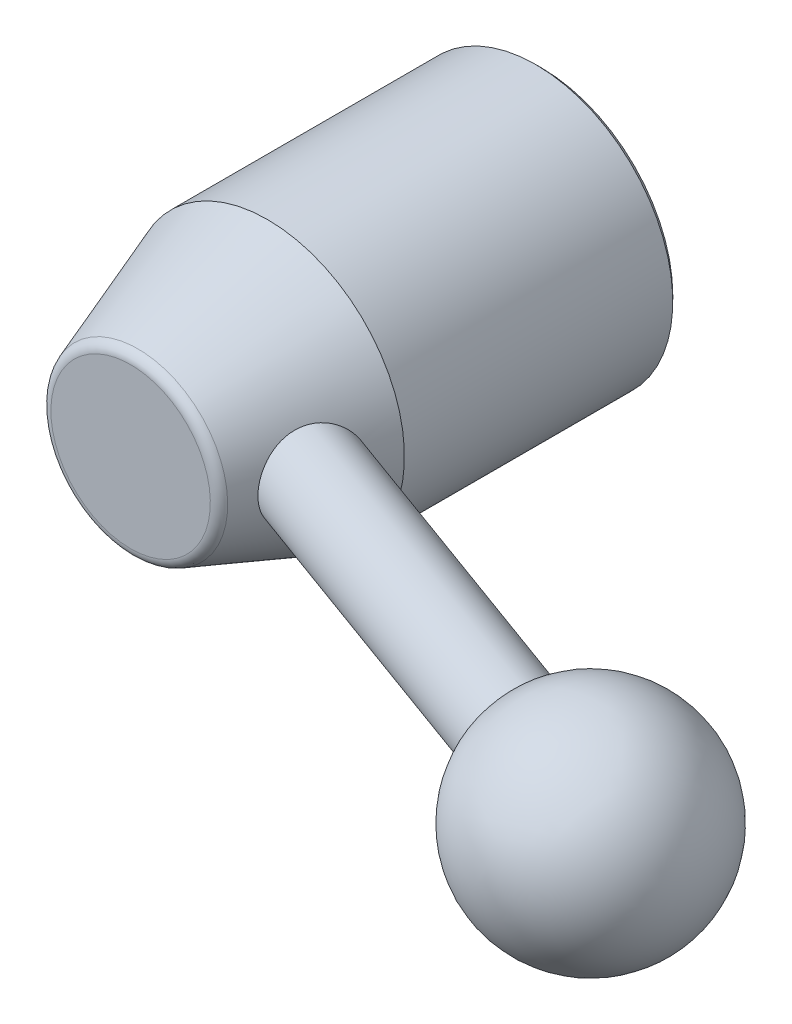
ISO-10303-21;
HEADER;
FILE_DESCRIPTION(('STEP AP214'),'2;1');
FILE_NAME('part.step','',(''),(''),'','','');
FILE_SCHEMA(('AUTOMOTIVE_DESIGN { 1 0 10303 214 1 1 1 1 }'));
ENDSEC;
DATA;
#1=APPLICATION_CONTEXT('core data for automotive mechanical design processes');
#2=APPLICATION_PROTOCOL_DEFINITION('international standard','automotive_design',2000,#1);
#3=PRODUCT_CONTEXT('',#1,'mechanical');
#4=PRODUCT('Part','Part','',(#3));
#5=PRODUCT_RELATED_PRODUCT_CATEGORY('part','',(#4));
#6=PRODUCT_DEFINITION_FORMATION('','',#4);
#7=PRODUCT_DEFINITION_CONTEXT('part definition',#1,'design');
#8=PRODUCT_DEFINITION('design','',#6,#7);
#9=PRODUCT_DEFINITION_SHAPE('','',#8);
#10=(LENGTH_UNIT() NAMED_UNIT(*) SI_UNIT(.MILLI.,.METRE.));
#11=(NAMED_UNIT(*) PLANE_ANGLE_UNIT() SI_UNIT($,.RADIAN.));
#12=(NAMED_UNIT(*) SI_UNIT($,.STERADIAN.) SOLID_ANGLE_UNIT());
#13=UNCERTAINTY_MEASURE_WITH_UNIT(LENGTH_MEASURE(1.E-05),#10,'distance_accuracy_value','');
#14=(GEOMETRIC_REPRESENTATION_CONTEXT(3) GLOBAL_UNCERTAINTY_ASSIGNED_CONTEXT((#13)) GLOBAL_UNIT_ASSIGNED_CONTEXT((#10,
#11,#12)) REPRESENTATION_CONTEXT('',''));
#15=CARTESIAN_POINT('',(0.,0.,0.));
#16=DIRECTION('',(0.,0.,1.));
#17=DIRECTION('',(1.,0.,0.));
#18=AXIS2_PLACEMENT_3D('',#15,#16,#17);
#19=CARTESIAN_POINT('',(0.,0.,36.831382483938));
#20=DIRECTION('',(0.,0.,-1.));
#21=DIRECTION('',(0.,1.,0.));
#22=AXIS2_PLACEMENT_3D('',#19,#20,#21);
#23=CONICAL_SURFACE('',#22,8.193728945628,0.349065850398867);
#24=CARTESIAN_POINT('',(0.,0.,36.831382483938));
#25=DIRECTION('',(0.,0.,1.));
#26=DIRECTION('',(0.,-1.,0.));
#27=AXIS2_PLACEMENT_3D('',#24,#25,#26);
#28=CIRCLE('',#27,8.193728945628);
#29=CARTESIAN_POINT('',(0.,-8.193728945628,36.831382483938));
#30=VERTEX_POINT('',#29);
#31=EDGE_CURVE('E38',#30,#30,#28,.T.);
#32=ORIENTED_EDGE('',*,*,#31,.F.);
#33=EDGE_LOOP('',(#32));
#34=FACE_BOUND('',#33,.T.);
#35=CARTESIAN_POINT('',(0.,0.,25.));
#36=DIRECTION('',(0.,0.,1.));
#37=DIRECTION('',(0.,-1.,0.));
#38=AXIS2_PLACEMENT_3D('',#35,#36,#37);
#39=CIRCLE('',#38,12.5);
#40=CARTESIAN_POINT('',(0.,-12.5,25.));
#41=VERTEX_POINT('',#40);
#42=EDGE_CURVE('E23',#41,#41,#39,.T.);
#43=ORIENTED_EDGE('',*,*,#42,.T.);
#44=EDGE_LOOP('',(#43));
#45=FACE_BOUND('',#44,.T.);
#46=CARTESIAN_POINT('',(11.0638383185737,-2.61564163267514,28.1078877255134));
#47=CARTESIAN_POINT('',(10.976180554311,-2.7872298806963,28.2338042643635));
#48=CARTESIAN_POINT('',(10.881953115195,-2.94594466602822,28.3726588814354));
#49=CARTESIAN_POINT('',(10.6855730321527,-3.23366844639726,28.6736056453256));
#50=CARTESIAN_POINT('',(10.5834203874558,-3.36267743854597,28.8356977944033));
#51=CARTESIAN_POINT('',(10.3766397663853,-3.58763894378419,29.1804275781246));
#52=CARTESIAN_POINT('',(10.2720087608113,-3.68354850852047,29.3630915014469));
#53=CARTESIAN_POINT('',(10.066273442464,-3.83893901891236,29.7451561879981));
#54=CARTESIAN_POINT('',(9.96516805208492,-3.8984311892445,29.9445517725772));
#55=CARTESIAN_POINT('',(9.77503707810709,-3.97742741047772,30.3492871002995));
#56=CARTESIAN_POINT('',(9.6857440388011,-3.99805391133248,30.5542805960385));
#57=CARTESIAN_POINT('',(9.52039760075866,-4.00168080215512,30.9698284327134));
#58=CARTESIAN_POINT('',(9.44433869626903,-3.98469687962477,31.1803804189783));
#59=CARTESIAN_POINT('',(9.31209727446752,-3.91567745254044,31.5888215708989));
#60=CARTESIAN_POINT('',(9.25505157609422,-3.86562134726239,31.7867702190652));
#61=CARTESIAN_POINT('',(9.15602959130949,-3.7342776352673,32.1759341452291));
#62=CARTESIAN_POINT('',(9.11405496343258,-3.65298659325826,32.3671486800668));
#63=CARTESIAN_POINT('',(9.04377915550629,-3.46066664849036,32.7396797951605));
#64=CARTESIAN_POINT('',(9.01565147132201,-3.3492862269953,32.9208467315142));
#65=CARTESIAN_POINT('',(8.9715254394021,-3.10030807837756,33.2658426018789));
#66=CARTESIAN_POINT('',(8.95553201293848,-2.96269974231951,33.4296644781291));
#67=CARTESIAN_POINT('',(8.93189808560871,-2.65419844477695,33.7459444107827));
#68=CARTESIAN_POINT('',(8.92490364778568,-2.48167276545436,33.8968590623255));
#69=CARTESIAN_POINT('',(8.91741466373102,-2.11404972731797,34.1686726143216));
#70=CARTESIAN_POINT('',(8.91692097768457,-1.91894938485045,34.289567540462));
#71=CARTESIAN_POINT('',(8.91831073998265,-1.61176989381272,34.4452466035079));
#72=CARTESIAN_POINT('',(8.91914285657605,-1.50614523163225,34.4931105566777));
#73=CARTESIAN_POINT('',(8.92112779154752,-1.29107121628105,34.5792453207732));
#74=CARTESIAN_POINT('',(8.92228047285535,-1.18162351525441,34.6175202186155));
#75=CARTESIAN_POINT('',(8.92455352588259,-0.959738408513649,34.6839450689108));
#76=CARTESIAN_POINT('',(8.9256739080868,-0.847301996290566,34.712098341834));
#77=CARTESIAN_POINT('',(8.92761261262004,-0.620303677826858,34.7578832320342));
#78=CARTESIAN_POINT('',(8.92843095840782,-0.505741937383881,34.7755156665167));
#79=CARTESIAN_POINT('',(8.92955078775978,-0.283453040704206,34.7991348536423));
#80=CARTESIAN_POINT('',(8.9298841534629,-0.175802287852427,34.8058438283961));
#81=CARTESIAN_POINT('',(8.9300801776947,0.0397111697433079,34.8098183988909));
#82=CARTESIAN_POINT('',(8.92994267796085,0.147573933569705,34.8070808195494));
#83=CARTESIAN_POINT('',(8.92921977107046,0.36259812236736,34.7921926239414));
#84=CARTESIAN_POINT('',(8.92863458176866,0.469759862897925,34.7800465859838));
#85=CARTESIAN_POINT('',(8.92712534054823,0.682639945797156,34.7465258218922));
#86=CARTESIAN_POINT('',(8.92620116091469,0.788357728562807,34.7251476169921));
#87=CARTESIAN_POINT('',(8.92324316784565,1.09503531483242,34.6493055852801));
#88=CARTESIAN_POINT('',(8.92097699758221,1.29308836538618,34.5825652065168));
#89=CARTESIAN_POINT('',(8.91777628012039,1.67599097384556,34.4185712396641));
#90=CARTESIAN_POINT('',(8.91684208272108,1.86083705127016,34.3213096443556));
#91=CARTESIAN_POINT('',(8.91898073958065,2.22356032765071,34.0936368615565));
#92=CARTESIAN_POINT('',(8.92228215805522,2.40045923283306,33.9616676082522));
#93=CARTESIAN_POINT('',(8.93673748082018,2.73166153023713,33.67219531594));
#94=CARTESIAN_POINT('',(8.94789479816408,2.88595506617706,33.5146812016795));
#95=CARTESIAN_POINT('',(8.98251755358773,3.17677766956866,33.1689329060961));
#96=CARTESIAN_POINT('',(9.00666532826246,3.31173787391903,32.9794401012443));
#97=CARTESIAN_POINT('',(9.07114537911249,3.54834979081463,32.5831851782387));
#98=CARTESIAN_POINT('',(9.11147187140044,3.65001338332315,32.3764292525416));
#99=CARTESIAN_POINT('',(9.20868073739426,3.8135433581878,31.9595506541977));
#100=CARTESIAN_POINT('',(9.26497294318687,3.87661217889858,31.749764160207));
#101=CARTESIAN_POINT('',(9.39431151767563,3.96553100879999,31.3275152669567));
#102=CARTESIAN_POINT('',(9.46735124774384,3.99139573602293,31.1150539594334));
#103=CARTESIAN_POINT('',(9.62266231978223,4.00455129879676,30.7074764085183));
#104=CARTESIAN_POINT('',(9.70407848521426,3.99413825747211,30.5121024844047));
#105=CARTESIAN_POINT('',(9.87590841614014,3.94034290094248,30.1300642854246));
#106=CARTESIAN_POINT('',(9.9663232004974,3.89695684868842,29.9434010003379));
#107=CARTESIAN_POINT('',(10.1530481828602,3.77804994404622,29.5805245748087));
#108=CARTESIAN_POINT('',(10.2494191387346,3.70212391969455,29.404476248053));
#109=CARTESIAN_POINT('',(10.4423176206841,3.52038975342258,29.0686427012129));
#110=CARTESIAN_POINT('',(10.5388451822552,3.41457347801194,28.9088619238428));
#111=CARTESIAN_POINT('',(10.7330141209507,3.16866637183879,28.5992726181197));
#112=CARTESIAN_POINT('',(10.8303867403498,3.02692496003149,28.4506043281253));
#113=CARTESIAN_POINT('',(11.0149804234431,2.71642714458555,28.1770157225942));
#114=CARTESIAN_POINT('',(11.1021995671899,2.54766564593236,28.0520998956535));
#115=CARTESIAN_POINT('',(11.2635266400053,2.18307798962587,27.8259377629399));
#116=CARTESIAN_POINT('',(11.3372901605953,1.98672233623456,27.7252962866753));
#117=CARTESIAN_POINT('',(11.4646763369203,1.57529311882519,27.5539537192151));
#118=CARTESIAN_POINT('',(11.5183036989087,1.36022394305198,27.4832456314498));
#119=CARTESIAN_POINT('',(11.6005351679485,0.925082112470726,27.375627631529));
#120=CARTESIAN_POINT('',(11.6299148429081,0.705416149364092,27.3376682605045));
#121=CARTESIAN_POINT('',(11.6646940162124,0.261097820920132,27.2927900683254));
#122=CARTESIAN_POINT('',(11.6701005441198,0.0364469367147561,27.28586214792));
#123=CARTESIAN_POINT('',(11.6568563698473,-0.402253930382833,27.3029102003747));
#124=CARTESIAN_POINT('',(11.6391235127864,-0.616379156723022,27.3257070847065));
#125=CARTESIAN_POINT('',(11.5822705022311,-1.036789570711,27.3994993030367));
#126=CARTESIAN_POINT('',(11.5431463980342,-1.24307330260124,27.4504998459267));
#127=CARTESIAN_POINT('',(11.4420883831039,-1.657400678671,27.5842243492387));
#128=CARTESIAN_POINT('',(11.37865452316,-1.86439989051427,27.6690538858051));
#129=CARTESIAN_POINT('',(11.233649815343,-2.25716631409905,27.8675081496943));
#130=CARTESIAN_POINT('',(11.1520722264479,-2.44292559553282,27.981143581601));
#131=CARTESIAN_POINT('',(11.0638383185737,-2.61564163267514,28.1078877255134));
#132=B_SPLINE_CURVE_WITH_KNOTS('',3,(#46,#47,#48,#49,#50,#51,#52,#53,#54,#55,#56,#57,#58,#59,
#60,#61,#62,#63,#64,#65,#66,#67,#68,#69,#70,#71,#72,#73,#74,#75,#76,#77,#78,#79,#80,#81,#82,#83,
#84,#85,#86,#87,#88,#89,#90,#91,#92,#93,#94,#95,#96,#97,#98,#99,#100,#101,#102,#103,#104,#105,
#106,#107,#108,#109,#110,#111,#112,#113,#114,#115,#116,#117,#118,#119,#120,#121,#122,#123,#124,
#125,#126,#127,#128,#129,#130,#131),.UNSPECIFIED.,.T.,.F.,(4,2,2,2,2,2,2,2,2,2,2,2,2,2,2,2,2,2,
2,2,2,2,2,2,2,2,2,2,2,2,2,2,2,2,2,2,2,2,2,2,2,2,4),(0.,0.689711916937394,1.37942390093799,
2.07002748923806,2.76041811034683,3.43054488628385,4.10039220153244,4.73339454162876,
5.36646652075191,6.00728059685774,6.64835442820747,7.33327142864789,8.01827905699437,
8.36579735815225,8.71316729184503,9.06042316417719,9.40765205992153,9.73082342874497,
10.0541034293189,10.3772262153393,10.7004708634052,11.3244812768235,11.9486555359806,
12.6079717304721,13.2675745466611,13.9657937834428,14.6637636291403,15.3387038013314,
16.0133768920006,16.6461445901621,17.2789840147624,17.9199432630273,18.5610770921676,
19.2399416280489,19.9189343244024,20.6134133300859,21.3077299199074,21.978868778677,
22.6498108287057,23.2949313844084,23.9401711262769,24.6341580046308,25.3284031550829),.UNSPECIFIED.);
#133=CARTESIAN_POINT('',(11.0638383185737,-2.61564163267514,28.1078877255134));
#134=VERTEX_POINT('',#133);
#135=EDGE_CURVE('E50',#134,#134,#132,.T.);
#136=ORIENTED_EDGE('',*,*,#135,.T.);
#137=EDGE_LOOP('',(#136));
#138=FACE_BOUND('',#137,.T.);
#139=ADVANCED_FACE('F12',(#34,#45,#138),#23,.T.);
#140=CARTESIAN_POINT('',(0.,0.,44.040929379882));
#141=DIRECTION('',(0.,0.,1.));
#142=DIRECTION('',(0.,-1.,0.));
#143=AXIS2_PLACEMENT_3D('',#140,#141,#142);
#144=CYLINDRICAL_SURFACE('',#143,12.5);
#145=CARTESIAN_POINT('',(0.,0.,0.5));
#146=DIRECTION('',(0.,0.,1.));
#147=DIRECTION('',(0.,-1.,0.));
#148=AXIS2_PLACEMENT_3D('',#145,#146,#147);
#149=CIRCLE('',#148,12.5);
#150=CARTESIAN_POINT('',(0.,-12.5,0.5));
#151=VERTEX_POINT('',#150);
#152=EDGE_CURVE('E27',#151,#151,#149,.T.);
#153=ORIENTED_EDGE('',*,*,#152,.T.);
#154=EDGE_LOOP('',(#153));
#155=FACE_BOUND('',#154,.T.);
#156=ORIENTED_EDGE('',*,*,#42,.F.);
#157=EDGE_LOOP('',(#156));
#158=FACE_BOUND('',#157,.T.);
#159=ADVANCED_FACE('F92',(#155,#158),#144,.T.);
#160=CARTESIAN_POINT('',(0.,0.,0.5));
#161=DIRECTION('',(0.,0.,1.));
#162=DIRECTION('',(0.,-1.,0.));
#163=AXIS2_PLACEMENT_3D('',#160,#161,#162);
#164=CONICAL_SURFACE('',#163,12.5,0.785398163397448);
#165=CARTESIAN_POINT('',(0.,0.,0.));
#166=DIRECTION('',(0.,0.,1.));
#167=DIRECTION('',(0.,-1.,0.));
#168=AXIS2_PLACEMENT_3D('',#165,#166,#167);
#169=CIRCLE('',#168,12.);
#170=CARTESIAN_POINT('',(0.,-12.,0.));
#171=VERTEX_POINT('',#170);
#172=EDGE_CURVE('E32',#171,#171,#169,.T.);
#173=ORIENTED_EDGE('',*,*,#172,.T.);
#174=EDGE_LOOP('',(#173));
#175=FACE_BOUND('',#174,.T.);
#176=ORIENTED_EDGE('',*,*,#152,.F.);
#177=EDGE_LOOP('',(#176));
#178=FACE_BOUND('',#177,.T.);
#179=ADVANCED_FACE('F90',(#175,#178),#164,.T.);
#180=CARTESIAN_POINT('',(-12.,0.,0.));
#181=DIRECTION('',(0.,0.,-1.));
#182=DIRECTION('',(0.,1.,0.));
#183=AXIS2_PLACEMENT_3D('',#180,#181,#182);
#184=PLANE('',#183);
#185=CARTESIAN_POINT('',(0.,0.,0.));
#186=DIRECTION('',(0.,0.,-1.));
#187=DIRECTION('',(-1.,0.,0.));
#188=AXIS2_PLACEMENT_3D('',#185,#186,#187);
#189=CIRCLE('',#188,5.5);
#190=CARTESIAN_POINT('',(-5.5,0.,0.));
#191=VERTEX_POINT('',#190);
#192=EDGE_CURVE('E8',#191,#191,#189,.F.);
#193=ORIENTED_EDGE('',*,*,#192,.T.);
#194=EDGE_LOOP('',(#193));
#195=FACE_BOUND('',#194,.T.);
#196=ORIENTED_EDGE('',*,*,#172,.F.);
#197=EDGE_LOOP('',(#196));
#198=FACE_BOUND('',#197,.T.);
#199=ADVANCED_FACE('F86',(#195,#198),#184,.T.);
#200=CARTESIAN_POINT('',(-7.27739892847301,0.,37.5));
#201=DIRECTION('',(0.,0.,-1.));
#202=DIRECTION('',(0.,1.,0.));
#203=AXIS2_PLACEMENT_3D('',#200,#201,#202);
#204=PLANE('',#203);
#205=CARTESIAN_POINT('',(0.,0.,37.5));
#206=DIRECTION('',(0.,0.,1.));
#207=DIRECTION('',(0.,-1.,0.));
#208=AXIS2_PLACEMENT_3D('',#205,#206,#207);
#209=CIRCLE('',#208,7.27739892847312);
#210=CARTESIAN_POINT('',(0.,-7.27739892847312,37.5));
#211=VERTEX_POINT('',#210);
#212=EDGE_CURVE('E35',#211,#211,#209,.T.);
#213=ORIENTED_EDGE('',*,*,#212,.T.);
#214=EDGE_LOOP('',(#213));
#215=FACE_BOUND('',#214,.T.);
#216=ADVANCED_FACE('F82',(#215),#204,.F.);
#217=CARTESIAN_POINT('',(0.,0.,36.500372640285));
#218=DIRECTION('',(0.,0.,1.));
#219=DIRECTION('',(0.,-1.,0.));
#220=AXIS2_PLACEMENT_3D('',#217,#218,#219);
#221=TOROIDAL_SURFACE('',#220,7.25010164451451,1.00000000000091);
#222=ORIENTED_EDGE('',*,*,#31,.T.);
#223=EDGE_LOOP('',(#222));
#224=FACE_BOUND('',#223,.T.);
#225=ORIENTED_EDGE('',*,*,#212,.F.);
#226=EDGE_LOOP('',(#225));
#227=FACE_BOUND('',#226,.T.);
#228=ADVANCED_FACE('F67',(#224,#227),#221,.T.);
#229=CARTESIAN_POINT('',(0.,0.,19.));
#230=DIRECTION('',(0.,0.,-1.));
#231=DIRECTION('',(-1.,0.,0.));
#232=AXIS2_PLACEMENT_3D('',#229,#230,#231);
#233=CYLINDRICAL_SURFACE('',#232,5.);
#234=CARTESIAN_POINT('',(0.,0.,0.499999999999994));
#235=DIRECTION('',(0.,0.,-1.));
#236=DIRECTION('',(-1.,0.,0.));
#237=AXIS2_PLACEMENT_3D('',#234,#235,#236);
#238=CIRCLE('',#237,5.);
#239=CARTESIAN_POINT('',(-5.,0.,0.499999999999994));
#240=VERTEX_POINT('',#239);
#241=EDGE_CURVE('E19',#240,#240,#238,.T.);
#242=ORIENTED_EDGE('',*,*,#241,.T.);
#243=EDGE_LOOP('',(#242));
#244=FACE_BOUND('',#243,.T.);
#245=CARTESIAN_POINT('',(0.,0.,19.));
#246=DIRECTION('',(0.,0.,-1.));
#247=DIRECTION('',(-1.,0.,0.));
#248=AXIS2_PLACEMENT_3D('',#245,#246,#247);
#249=CIRCLE('',#248,5.);
#250=CARTESIAN_POINT('',(-5.,0.,19.));
#251=VERTEX_POINT('',#250);
#252=EDGE_CURVE('E47',#251,#251,#249,.T.);
#253=ORIENTED_EDGE('',*,*,#252,.F.);
#254=EDGE_LOOP('',(#253));
#255=FACE_BOUND('',#254,.T.);
#256=ADVANCED_FACE('F63',(#244,#255),#233,.F.);
#257=CARTESIAN_POINT('',(0.,0.,19.));
#258=DIRECTION('',(0.,0.,-1.));
#259=DIRECTION('',(-1.,0.,0.));
#260=AXIS2_PLACEMENT_3D('',#257,#258,#259);
#261=PLANE('',#260);
#262=ORIENTED_EDGE('',*,*,#252,.T.);
#263=EDGE_LOOP('',(#262));
#264=FACE_BOUND('',#263,.T.);
#265=ADVANCED_FACE('F60',(#264),#261,.T.);
#266=CARTESIAN_POINT('',(0.,0.,0.499999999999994));
#267=DIRECTION('',(0.,0.,-1.));
#268=DIRECTION('',(-1.,0.,0.));
#269=AXIS2_PLACEMENT_3D('',#266,#267,#268);
#270=CONICAL_SURFACE('',#269,5.,0.785398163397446);
#271=ORIENTED_EDGE('',*,*,#192,.F.);
#272=EDGE_LOOP('',(#271));
#273=FACE_BOUND('',#272,.T.);
#274=ORIENTED_EDGE('',*,*,#241,.F.);
#275=EDGE_LOOP('',(#274));
#276=FACE_BOUND('',#275,.T.);
#277=ADVANCED_FACE('F14',(#273,#276),#270,.F.);
#278=CARTESIAN_POINT('',(50.,0.,45.5));
#279=DIRECTION('',(0.,-1.,0.));
#280=DIRECTION('',(1.,0.,0.));
#281=AXIS2_PLACEMENT_3D('',#278,#279,#280);
#282=SPHERICAL_SURFACE('',#281,10.);
#283=CARTESIAN_POINT('',(50.,0.,45.5));
#284=DIRECTION('',(0.939692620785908,0.,0.342020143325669));
#285=DIRECTION('',(-0.342020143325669,0.,0.939692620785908));
#286=AXIS2_PLACEMENT_3D('',#283,#284,#285);
#287=SPHERICAL_SURFACE('',#286,10.);
#288=CARTESIAN_POINT('',(41.3398340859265,0.,42.3479573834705));
#289=DIRECTION('',(0.939692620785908,0.,0.342020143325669));
#290=DIRECTION('',(-0.342020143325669,0.,0.939692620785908));
#291=AXIS2_PLACEMENT_3D('',#288,#289,#290);
#292=CIRCLE('',#291,3.88151435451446);
#293=CARTESIAN_POINT('',(40.0122779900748,0.,45.9953877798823));
#294=VERTEX_POINT('',#293);
#295=EDGE_CURVE('E41',#294,#294,#292,.T.);
#296=ORIENTED_EDGE('',*,*,#295,.T.);
#297=EDGE_LOOP('',(#296));
#298=FACE_BOUND('',#297,.T.);
#299=ADVANCED_FACE('F75',(#298),#287,.T.);
#300=CARTESIAN_POINT('',(40.012277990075,0.,45.9953877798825));
#301=DIRECTION('',(0.939692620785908,0.,0.342020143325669));
#302=DIRECTION('',(-0.342020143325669,0.,0.939692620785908));
#303=AXIS2_PLACEMENT_3D('',#300,#301,#302);
#304=PLANE('',#303);
#305=CARTESIAN_POINT('',(41.339834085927,0.,42.3479573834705));
#306=DIRECTION('',(0.939692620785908,0.,0.342020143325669));
#307=DIRECTION('',(-0.342020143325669,0.,0.939692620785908));
#308=AXIS2_PLACEMENT_3D('',#305,#306,#307);
#309=CIRCLE('',#308,4.);
#310=CARTESIAN_POINT('',(39.9717535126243,0.,46.1067278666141));
#311=VERTEX_POINT('',#310);
#312=EDGE_CURVE('E44',#311,#311,#309,.T.);
#313=ORIENTED_EDGE('',*,*,#312,.T.);
#314=EDGE_LOOP('',(#313));
#315=FACE_BOUND('',#314,.T.);
#316=ORIENTED_EDGE('',*,*,#295,.F.);
#317=EDGE_LOOP('',(#316));
#318=FACE_BOUND('',#317,.T.);
#319=ADVANCED_FACE('F71',(#315,#318),#304,.T.);
#320=CARTESIAN_POINT('',(65.431555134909,0.,51.1166267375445));
#321=DIRECTION('',(0.939692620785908,0.,0.342020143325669));
#322=DIRECTION('',(-0.342020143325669,0.,0.939692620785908));
#323=AXIS2_PLACEMENT_3D('',#320,#321,#322);
#324=CYLINDRICAL_SURFACE('',#323,4.);
#325=ORIENTED_EDGE('',*,*,#312,.F.);
#326=EDGE_LOOP('',(#325));
#327=FACE_BOUND('',#326,.T.);
#328=ORIENTED_EDGE('',*,*,#135,.F.);
#329=EDGE_LOOP('',(#328));
#330=FACE_BOUND('',#329,.T.);
#331=ADVANCED_FACE('F68',(#327,#330),#324,.T.);
#332=CLOSED_SHELL('',(#139,#159,#179,#199,#216,#228,#256,#265,#277,#299,#319,#331));
#333=MANIFOLD_SOLID_BREP('B1',#332);
#334=ADVANCED_BREP_SHAPE_REPRESENTATION('',(#18,#333),#14);
#335=SHAPE_DEFINITION_REPRESENTATION(#9,#334);
ENDSEC;
END-ISO-10303-21;
